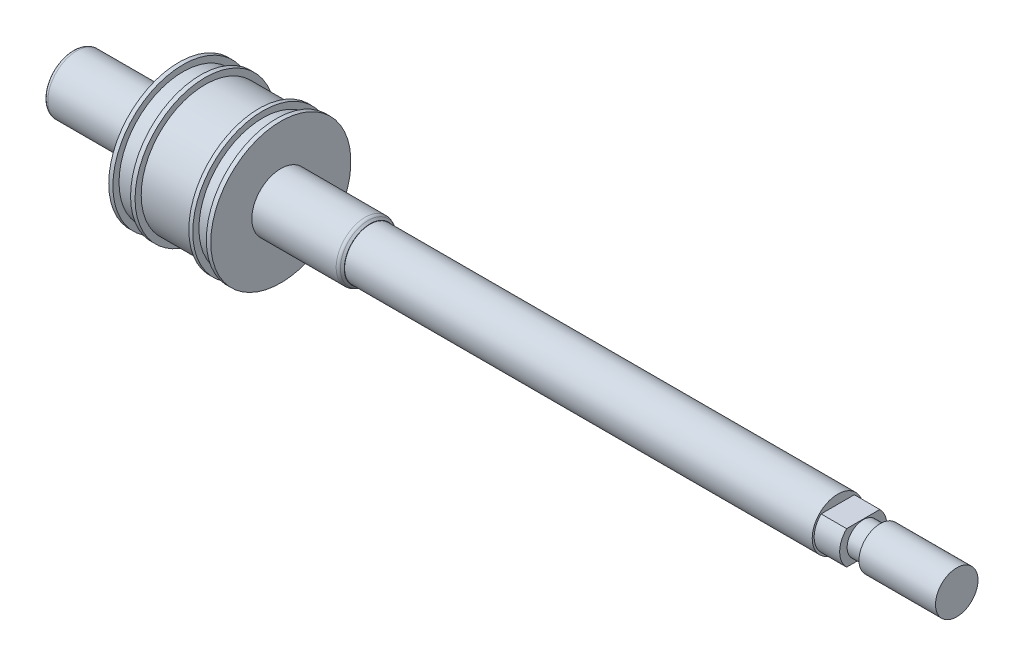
ISO-10303-21;
HEADER;
FILE_DESCRIPTION(('STEP AP214'),'2;1');
FILE_NAME('part.step','',(''),(''),'','','');
FILE_SCHEMA(('AUTOMOTIVE_DESIGN { 1 0 10303 214 1 1 1 1 }'));
ENDSEC;
DATA;
#1=APPLICATION_CONTEXT('core data for automotive mechanical design processes');
#2=APPLICATION_PROTOCOL_DEFINITION('international standard','automotive_design',2000,#1);
#3=PRODUCT_CONTEXT('',#1,'mechanical');
#4=PRODUCT('Part','Part','',(#3));
#5=PRODUCT_RELATED_PRODUCT_CATEGORY('part','',(#4));
#6=PRODUCT_DEFINITION_FORMATION('','',#4);
#7=PRODUCT_DEFINITION_CONTEXT('part definition',#1,'design');
#8=PRODUCT_DEFINITION('design','',#6,#7);
#9=PRODUCT_DEFINITION_SHAPE('','',#8);
#10=(LENGTH_UNIT() NAMED_UNIT(*) SI_UNIT(.MILLI.,.METRE.));
#11=(NAMED_UNIT(*) PLANE_ANGLE_UNIT() SI_UNIT($,.RADIAN.));
#12=(NAMED_UNIT(*) SI_UNIT($,.STERADIAN.) SOLID_ANGLE_UNIT());
#13=UNCERTAINTY_MEASURE_WITH_UNIT(LENGTH_MEASURE(1.E-05),#10,'distance_accuracy_value','');
#14=(GEOMETRIC_REPRESENTATION_CONTEXT(3) GLOBAL_UNCERTAINTY_ASSIGNED_CONTEXT((#13)) GLOBAL_UNIT_ASSIGNED_CONTEXT((#10,
#11,#12)) REPRESENTATION_CONTEXT('',''));
#15=CARTESIAN_POINT('',(0.,0.,0.));
#16=DIRECTION('',(0.,0.,1.));
#17=DIRECTION('',(1.,0.,0.));
#18=AXIS2_PLACEMENT_3D('',#15,#16,#17);
#19=CARTESIAN_POINT('',(49.,0.,0.));
#20=DIRECTION('',(-1.,0.,0.));
#21=DIRECTION('',(0.,0.,1.));
#22=AXIS2_PLACEMENT_3D('',#19,#20,#21);
#23=CYLINDRICAL_SURFACE('',#22,16.4793670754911);
#24=CARTESIAN_POINT('',(49.,0.,0.));
#25=DIRECTION('',(-1.,0.,0.));
#26=DIRECTION('',(0.,0.,1.));
#27=AXIS2_PLACEMENT_3D('',#24,#25,#26);
#28=CIRCLE('',#27,16.4793670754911);
#29=CARTESIAN_POINT('',(49.,0.,16.4793670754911));
#30=VERTEX_POINT('',#29);
#31=EDGE_CURVE('E139',#30,#30,#28,.T.);
#32=ORIENTED_EDGE('',*,*,#31,.T.);
#33=EDGE_LOOP('',(#32));
#34=FACE_BOUND('',#33,.T.);
#35=CARTESIAN_POINT('',(47.9508311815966,0.,0.));
#36=DIRECTION('',(-1.,0.,0.));
#37=DIRECTION('',(0.,0.,1.));
#38=AXIS2_PLACEMENT_3D('',#35,#36,#37);
#39=CIRCLE('',#38,16.4793670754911);
#40=CARTESIAN_POINT('',(47.9508311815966,0.,16.4793670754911));
#41=VERTEX_POINT('',#40);
#42=EDGE_CURVE('E155',#41,#41,#39,.F.);
#43=ORIENTED_EDGE('',*,*,#42,.T.);
#44=EDGE_LOOP('',(#43));
#45=FACE_BOUND('',#44,.T.);
#46=ADVANCED_FACE('F34',(#34,#45),#23,.T.);
#47=CARTESIAN_POINT('',(70.,0.,0.));
#48=DIRECTION('',(-1.,0.,0.));
#49=DIRECTION('',(0.,0.,1.));
#50=AXIS2_PLACEMENT_3D('',#47,#48,#49);
#51=CYLINDRICAL_SURFACE('',#50,6.82545551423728);
#52=CARTESIAN_POINT('',(68.835786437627,0.,0.));
#53=DIRECTION('',(1.,0.,0.));
#54=DIRECTION('',(0.,0.,-1.));
#55=AXIS2_PLACEMENT_3D('',#52,#53,#54);
#56=CIRCLE('',#55,6.82545551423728);
#57=CARTESIAN_POINT('',(68.835786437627,0.,-6.82545551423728));
#58=VERTEX_POINT('',#57);
#59=EDGE_CURVE('E124',#58,#58,#56,.F.);
#60=ORIENTED_EDGE('',*,*,#59,.T.);
#61=EDGE_LOOP('',(#60));
#62=FACE_BOUND('',#61,.T.);
#63=CARTESIAN_POINT('',(49.,0.,0.));
#64=DIRECTION('',(-1.,0.,0.));
#65=DIRECTION('',(0.,0.,1.));
#66=AXIS2_PLACEMENT_3D('',#63,#64,#65);
#67=CIRCLE('',#66,6.82545551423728);
#68=CARTESIAN_POINT('',(49.,0.,6.82545551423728));
#69=VERTEX_POINT('',#68);
#70=EDGE_CURVE('E135',#69,#69,#67,.F.);
#71=ORIENTED_EDGE('',*,*,#70,.T.);
#72=EDGE_LOOP('',(#71));
#73=FACE_BOUND('',#72,.T.);
#74=ADVANCED_FACE('F205',(#62,#73),#51,.T.);
#75=CARTESIAN_POINT('',(180.,0.,0.));
#76=DIRECTION('',(-1.,0.,0.));
#77=DIRECTION('',(0.,0.,1.));
#78=AXIS2_PLACEMENT_3D('',#75,#76,#77);
#79=CYLINDRICAL_SURFACE('',#78,6.);
#80=CARTESIAN_POINT('',(180.,0.,0.));
#81=DIRECTION('',(1.,0.,0.));
#82=DIRECTION('',(0.,0.,-1.));
#83=AXIS2_PLACEMENT_3D('',#80,#81,#82);
#84=CIRCLE('',#83,6.);
#85=CARTESIAN_POINT('',(180.,0.,6.));
#86=VERTEX_POINT('',#85);
#87=EDGE_CURVE('E115',#86,#86,#84,.T.);
#88=CARTESIAN_POINT('',(70.,0.,0.));
#89=DIRECTION('',(-1.,0.,0.));
#90=DIRECTION('',(0.,0.,1.));
#91=AXIS2_PLACEMENT_3D('',#88,#89,#90);
#92=CIRCLE('',#91,6.);
#93=CARTESIAN_POINT('',(70.,0.,6.));
#94=VERTEX_POINT('',#93);
#95=EDGE_CURVE('E118',#94,#94,#92,.T.);
#96=CARTESIAN_POINT('',(180.,0.,6.));
#97=CARTESIAN_POINT('',(178.854166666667,0.,6.));
#98=CARTESIAN_POINT('',(177.708333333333,0.,6.));
#99=CARTESIAN_POINT('',(175.416666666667,0.,6.));
#100=CARTESIAN_POINT('',(174.270833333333,0.,6.));
#101=CARTESIAN_POINT('',(171.979166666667,0.,6.));
#102=CARTESIAN_POINT('',(170.833333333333,0.,6.));
#103=CARTESIAN_POINT('',(168.541666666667,0.,6.));
#104=CARTESIAN_POINT('',(167.395833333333,0.,6.));
#105=CARTESIAN_POINT('',(165.104166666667,0.,6.));
#106=CARTESIAN_POINT('',(163.958333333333,0.,6.));
#107=CARTESIAN_POINT('',(161.666666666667,0.,6.));
#108=CARTESIAN_POINT('',(160.520833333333,0.,6.));
#109=CARTESIAN_POINT('',(158.229166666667,0.,6.));
#110=CARTESIAN_POINT('',(157.083333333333,0.,6.));
#111=CARTESIAN_POINT('',(154.791666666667,0.,6.));
#112=CARTESIAN_POINT('',(153.645833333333,0.,6.));
#113=CARTESIAN_POINT('',(151.354166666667,0.,6.));
#114=CARTESIAN_POINT('',(150.208333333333,0.,6.));
#115=CARTESIAN_POINT('',(147.916666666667,0.,6.));
#116=CARTESIAN_POINT('',(146.770833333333,0.,6.));
#117=CARTESIAN_POINT('',(144.479166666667,0.,6.));
#118=CARTESIAN_POINT('',(143.333333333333,0.,6.));
#119=CARTESIAN_POINT('',(141.041666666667,0.,6.));
#120=CARTESIAN_POINT('',(139.895833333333,0.,6.));
#121=CARTESIAN_POINT('',(137.604166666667,0.,6.));
#122=CARTESIAN_POINT('',(136.458333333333,0.,6.));
#123=CARTESIAN_POINT('',(134.166666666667,0.,6.));
#124=CARTESIAN_POINT('',(133.020833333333,0.,6.));
#125=CARTESIAN_POINT('',(130.729166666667,0.,6.));
#126=CARTESIAN_POINT('',(129.583333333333,0.,6.));
#127=CARTESIAN_POINT('',(127.291666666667,0.,6.));
#128=CARTESIAN_POINT('',(126.145833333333,0.,6.));
#129=CARTESIAN_POINT('',(123.854166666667,0.,6.));
#130=CARTESIAN_POINT('',(122.708333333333,0.,6.));
#131=CARTESIAN_POINT('',(120.416666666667,0.,6.));
#132=CARTESIAN_POINT('',(119.270833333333,0.,6.));
#133=CARTESIAN_POINT('',(116.979166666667,0.,6.));
#134=CARTESIAN_POINT('',(115.833333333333,0.,6.));
#135=CARTESIAN_POINT('',(113.541666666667,0.,6.));
#136=CARTESIAN_POINT('',(112.395833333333,0.,6.));
#137=CARTESIAN_POINT('',(110.104166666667,0.,6.));
#138=CARTESIAN_POINT('',(108.958333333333,0.,6.));
#139=CARTESIAN_POINT('',(106.666666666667,0.,6.));
#140=CARTESIAN_POINT('',(105.520833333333,0.,6.));
#141=CARTESIAN_POINT('',(103.229166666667,0.,6.));
#142=CARTESIAN_POINT('',(102.083333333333,0.,6.));
#143=CARTESIAN_POINT('',(99.7916666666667,0.,6.));
#144=CARTESIAN_POINT('',(98.6458333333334,0.,6.));
#145=CARTESIAN_POINT('',(96.3541666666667,0.,6.));
#146=CARTESIAN_POINT('',(95.2083333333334,0.,6.));
#147=CARTESIAN_POINT('',(92.9166666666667,0.,6.));
#148=CARTESIAN_POINT('',(91.7708333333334,0.,6.));
#149=CARTESIAN_POINT('',(89.4791666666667,0.,6.));
#150=CARTESIAN_POINT('',(88.3333333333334,0.,6.));
#151=CARTESIAN_POINT('',(86.0416666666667,0.,6.));
#152=CARTESIAN_POINT('',(84.8958333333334,0.,6.));
#153=CARTESIAN_POINT('',(82.6041666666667,0.,6.));
#154=CARTESIAN_POINT('',(81.4583333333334,0.,6.));
#155=CARTESIAN_POINT('',(79.1666666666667,0.,6.));
#156=CARTESIAN_POINT('',(78.0208333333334,0.,6.));
#157=CARTESIAN_POINT('',(75.7291666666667,0.,6.));
#158=CARTESIAN_POINT('',(74.5833333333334,0.,6.));
#159=CARTESIAN_POINT('',(72.2916666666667,0.,6.));
#160=CARTESIAN_POINT('',(71.1458333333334,0.,6.));
#161=CARTESIAN_POINT('',(70.,0.,6.));
#162=B_SPLINE_CURVE_WITH_KNOTS('',3,(#96,#97,#98,#99,#100,#101,#102,#103,#104,#105,#106,#107,
#108,#109,#110,#111,#112,#113,#114,#115,#116,#117,#118,#119,#120,#121,#122,#123,#124,#125,#126,
#127,#128,#129,#130,#131,#132,#133,#134,#135,#136,#137,#138,#139,#140,#141,#142,#143,#144,#145,
#146,#147,#148,#149,#150,#151,#152,#153,#154,#155,#156,#157,#158,#159,#160,#161),.UNSPECIFIED.,
.F.,.F.,(4,2,2,2,2,2,2,2,2,2,2,2,2,2,2,2,2,2,2,2,2,2,2,2,2,2,2,2,2,2,2,2,4),(0.,
3.43749999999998,6.87499999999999,10.3125,13.75,17.1875,20.625,24.0625,27.5,30.9375,34.375,
37.8124999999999,41.25,44.6875,48.1249999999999,51.5625,55.,58.4375,61.875,65.3124999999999,
68.7499999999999,72.1874999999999,75.6249999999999,79.0624999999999,82.4999999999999,
85.9374999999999,89.3749999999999,92.8124999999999,96.2499999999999,99.6874999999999,103.125,
106.5625,110.),.UNSPECIFIED.);
#163=EDGE_CURVE('BSEAM196',#86,#94,#162,.T.);
#164=ORIENTED_EDGE('',*,*,#87,.F.);
#165=ORIENTED_EDGE('',*,*,#95,.F.);
#166=ORIENTED_EDGE('',*,*,#163,.T.);
#167=ORIENTED_EDGE('',*,*,#163,.F.);
#168=EDGE_LOOP('',(#164,#166,#165,#167));
#169=FACE_BOUND('',#168,.T.);
#170=ADVANCED_FACE('F196',(#169),#79,.T.);
#171=CARTESIAN_POINT('',(186.,0.,0.));
#172=DIRECTION('',(1.,0.,0.));
#173=DIRECTION('',(0.,0.,-1.));
#174=AXIS2_PLACEMENT_3D('',#171,#172,#173);
#175=PLANE('',#174);
#176=CARTESIAN_POINT('',(186.,0.,0.));
#177=DIRECTION('',(1.,0.,0.));
#178=DIRECTION('',(0.,0.,-1.));
#179=AXIS2_PLACEMENT_3D('',#176,#177,#178);
#180=CIRCLE('',#179,5.53675717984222);
#181=CARTESIAN_POINT('',(186.,3.92396631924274,3.90617055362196));
#182=VERTEX_POINT('',#181);
#183=CARTESIAN_POINT('',(186.,-3.92396631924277,3.90617055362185));
#184=VERTEX_POINT('',#183);
#185=EDGE_CURVE('E86',#182,#184,#180,.T.);
#186=ORIENTED_EDGE('',*,*,#185,.T.);
#187=DIRECTION('',(0.,0.,-1.));
#188=VECTOR('',#187,1.);
#189=CARTESIAN_POINT('',(186.,-3.92396631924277,-3.90617055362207));
#190=LINE('',#189,#188);
#191=CARTESIAN_POINT('',(186.,-3.92396631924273,-3.90617055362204));
#192=VERTEX_POINT('',#191);
#193=EDGE_CURVE('E80',#184,#192,#190,.T.);
#194=ORIENTED_EDGE('',*,*,#193,.T.);
#195=CARTESIAN_POINT('',(186.,0.,0.));
#196=DIRECTION('',(1.,0.,0.));
#197=DIRECTION('',(0.,0.,-1.));
#198=AXIS2_PLACEMENT_3D('',#195,#196,#197);
#199=CIRCLE('',#198,5.5367571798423);
#200=CARTESIAN_POINT('',(186.,3.92396631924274,-3.90617055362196));
#201=VERTEX_POINT('',#200);
#202=EDGE_CURVE('E84',#192,#201,#199,.T.);
#203=ORIENTED_EDGE('',*,*,#202,.T.);
#204=DIRECTION('',(0.,0.,1.));
#205=VECTOR('',#204,1.);
#206=CARTESIAN_POINT('',(186.,3.92396631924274,3.90617055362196));
#207=LINE('',#206,#205);
#208=EDGE_CURVE('E59',#201,#182,#207,.T.);
#209=ORIENTED_EDGE('',*,*,#208,.T.);
#210=EDGE_LOOP('',(#186,#194,#203,#209));
#211=FACE_BOUND('',#210,.T.);
#212=CARTESIAN_POINT('',(186.,0.,0.));
#213=DIRECTION('',(1.,0.,0.));
#214=DIRECTION('',(0.,0.,-1.));
#215=AXIS2_PLACEMENT_3D('',#212,#213,#214);
#216=CIRCLE('',#215,3.78830754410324);
#217=CARTESIAN_POINT('',(186.,0.,-3.78830754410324));
#218=VERTEX_POINT('',#217);
#219=EDGE_CURVE('E185',#218,#218,#216,.T.);
#220=ORIENTED_EDGE('',*,*,#219,.F.);
#221=EDGE_LOOP('',(#220));
#222=FACE_BOUND('',#221,.T.);
#223=ADVANCED_FACE('F81',(#211,#222),#175,.T.);
#224=CARTESIAN_POINT('',(180.,0.,0.));
#225=DIRECTION('',(1.,0.,0.));
#226=DIRECTION('',(0.,0.,-1.));
#227=AXIS2_PLACEMENT_3D('',#224,#225,#226);
#228=PLANE('',#227);
#229=ORIENTED_EDGE('',*,*,#87,.T.);
#230=EDGE_LOOP('',(#229));
#231=FACE_BOUND('',#230,.T.);
#232=DIRECTION('',(0.,0.,-1.));
#233=VECTOR('',#232,1.);
#234=CARTESIAN_POINT('',(180.,-3.92396631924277,-3.90617055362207));
#235=LINE('',#234,#233);
#236=CARTESIAN_POINT('',(180.,-3.92396631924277,3.90617055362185));
#237=VERTEX_POINT('',#236);
#238=CARTESIAN_POINT('',(180.,-3.92396631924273,-3.90617055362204));
#239=VERTEX_POINT('',#238);
#240=EDGE_CURVE('E93',#237,#239,#235,.T.);
#241=ORIENTED_EDGE('',*,*,#240,.F.);
#242=CARTESIAN_POINT('',(180.,0.,0.));
#243=DIRECTION('',(1.,0.,0.));
#244=DIRECTION('',(0.,0.,-1.));
#245=AXIS2_PLACEMENT_3D('',#242,#243,#244);
#246=CIRCLE('',#245,5.53675717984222);
#247=CARTESIAN_POINT('',(180.,3.92396631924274,3.90617055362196));
#248=VERTEX_POINT('',#247);
#249=EDGE_CURVE('E104',#248,#237,#246,.T.);
#250=ORIENTED_EDGE('',*,*,#249,.F.);
#251=DIRECTION('',(0.,0.,1.));
#252=VECTOR('',#251,1.);
#253=CARTESIAN_POINT('',(180.,3.92396631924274,3.90617055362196));
#254=LINE('',#253,#252);
#255=CARTESIAN_POINT('',(180.,3.92396631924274,-3.90617055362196));
#256=VERTEX_POINT('',#255);
#257=EDGE_CURVE('E73',#256,#248,#254,.T.);
#258=ORIENTED_EDGE('',*,*,#257,.F.);
#259=CARTESIAN_POINT('',(180.,0.,0.));
#260=DIRECTION('',(1.,0.,0.));
#261=DIRECTION('',(0.,0.,-1.));
#262=AXIS2_PLACEMENT_3D('',#259,#260,#261);
#263=CIRCLE('',#262,5.5367571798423);
#264=EDGE_CURVE('E109',#239,#256,#263,.T.);
#265=ORIENTED_EDGE('',*,*,#264,.F.);
#266=EDGE_LOOP('',(#241,#250,#258,#265));
#267=FACE_BOUND('',#266,.T.);
#268=ADVANCED_FACE('F195',(#231,#267),#228,.T.);
#269=CARTESIAN_POINT('',(186.,0.,0.));
#270=DIRECTION('',(-1.,0.,0.));
#271=DIRECTION('',(0.,0.,1.));
#272=AXIS2_PLACEMENT_3D('',#269,#270,#271);
#273=CYLINDRICAL_SURFACE('',#272,5.53675717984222);
#274=ORIENTED_EDGE('',*,*,#249,.T.);
#275=DIRECTION('',(-1.,0.,0.));
#276=VECTOR('',#275,1.);
#277=CARTESIAN_POINT('',(186.,-3.92396631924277,3.90617055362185));
#278=LINE('',#277,#276);
#279=EDGE_CURVE('E96',#184,#237,#278,.T.);
#280=ORIENTED_EDGE('',*,*,#279,.F.);
#281=ORIENTED_EDGE('',*,*,#185,.F.);
#282=DIRECTION('',(-1.,0.,0.));
#283=VECTOR('',#282,1.);
#284=CARTESIAN_POINT('',(186.,3.92396631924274,3.90617055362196));
#285=LINE('',#284,#283);
#286=EDGE_CURVE('E100',#182,#248,#285,.T.);
#287=ORIENTED_EDGE('',*,*,#286,.T.);
#288=EDGE_LOOP('',(#274,#280,#281,#287));
#289=FACE_BOUND('',#288,.T.);
#290=ADVANCED_FACE('F202',(#289),#273,.T.);
#291=CARTESIAN_POINT('',(186.,-3.92396631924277,-3.90617055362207));
#292=DIRECTION('',(0.,1.,0.));
#293=DIRECTION('',(0.,0.,1.));
#294=AXIS2_PLACEMENT_3D('',#291,#292,#293);
#295=PLANE('',#294);
#296=ORIENTED_EDGE('',*,*,#240,.T.);
#297=DIRECTION('',(-1.,0.,0.));
#298=VECTOR('',#297,1.);
#299=CARTESIAN_POINT('',(186.,-3.92396631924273,-3.90617055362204));
#300=LINE('',#299,#298);
#301=EDGE_CURVE('E90',#192,#239,#300,.T.);
#302=ORIENTED_EDGE('',*,*,#301,.F.);
#303=ORIENTED_EDGE('',*,*,#193,.F.);
#304=ORIENTED_EDGE('',*,*,#279,.T.);
#305=EDGE_LOOP('',(#296,#302,#303,#304));
#306=FACE_BOUND('',#305,.T.);
#307=ADVANCED_FACE('F91',(#306),#295,.F.);
#308=CARTESIAN_POINT('',(186.,0.,0.));
#309=DIRECTION('',(-1.,0.,0.));
#310=DIRECTION('',(0.,0.,1.));
#311=AXIS2_PLACEMENT_3D('',#308,#309,#310);
#312=CYLINDRICAL_SURFACE('',#311,5.5367571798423);
#313=ORIENTED_EDGE('',*,*,#264,.T.);
#314=DIRECTION('',(-1.,0.,0.));
#315=VECTOR('',#314,1.);
#316=CARTESIAN_POINT('',(186.,3.92396631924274,-3.90617055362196));
#317=LINE('',#316,#315);
#318=EDGE_CURVE('E51',#201,#256,#317,.T.);
#319=ORIENTED_EDGE('',*,*,#318,.F.);
#320=ORIENTED_EDGE('',*,*,#202,.F.);
#321=ORIENTED_EDGE('',*,*,#301,.T.);
#322=EDGE_LOOP('',(#313,#319,#320,#321));
#323=FACE_BOUND('',#322,.T.);
#324=ADVANCED_FACE('F98',(#323),#312,.T.);
#325=CARTESIAN_POINT('',(186.,3.92396631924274,3.90617055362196));
#326=DIRECTION('',(0.,-1.,0.));
#327=DIRECTION('',(0.,0.,-1.));
#328=AXIS2_PLACEMENT_3D('',#325,#326,#327);
#329=PLANE('',#328);
#330=ORIENTED_EDGE('',*,*,#257,.T.);
#331=ORIENTED_EDGE('',*,*,#286,.F.);
#332=ORIENTED_EDGE('',*,*,#208,.F.);
#333=ORIENTED_EDGE('',*,*,#318,.T.);
#334=EDGE_LOOP('',(#330,#331,#332,#333));
#335=FACE_BOUND('',#334,.T.);
#336=ADVANCED_FACE('F304',(#335),#329,.F.);
#337=CARTESIAN_POINT('',(190.,0.,0.));
#338=DIRECTION('',(-1.,0.,0.));
#339=DIRECTION('',(0.,0.,1.));
#340=AXIS2_PLACEMENT_3D('',#337,#338,#339);
#341=CYLINDRICAL_SURFACE('',#340,3.78830754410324);
#342=CARTESIAN_POINT('',(190.,0.,0.));
#343=DIRECTION('',(1.,0.,0.));
#344=DIRECTION('',(0.,0.,-1.));
#345=AXIS2_PLACEMENT_3D('',#342,#343,#344);
#346=CIRCLE('',#345,3.78830754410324);
#347=CARTESIAN_POINT('',(190.,0.,-3.78830754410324));
#348=VERTEX_POINT('',#347);
#349=EDGE_CURVE('E107',#348,#348,#346,.T.);
#350=ORIENTED_EDGE('',*,*,#349,.F.);
#351=EDGE_LOOP('',(#350));
#352=FACE_BOUND('',#351,.T.);
#353=ORIENTED_EDGE('',*,*,#219,.T.);
#354=EDGE_LOOP('',(#353));
#355=FACE_BOUND('',#354,.T.);
#356=ADVANCED_FACE('F193',(#352,#355),#341,.T.);
#357=CARTESIAN_POINT('',(190.,0.,0.));
#358=DIRECTION('',(1.,0.,0.));
#359=DIRECTION('',(0.,0.,-1.));
#360=AXIS2_PLACEMENT_3D('',#357,#358,#359);
#361=PLANE('',#360);
#362=CARTESIAN_POINT('',(190.,0.,0.));
#363=DIRECTION('',(1.,0.,0.));
#364=DIRECTION('',(0.,0.,-1.));
#365=AXIS2_PLACEMENT_3D('',#362,#363,#364);
#366=CIRCLE('',#365,5.);
#367=CARTESIAN_POINT('',(190.,0.,-5.));
#368=VERTEX_POINT('',#367);
#369=EDGE_CURVE('E138',#368,#368,#366,.T.);
#370=ORIENTED_EDGE('',*,*,#369,.F.);
#371=EDGE_LOOP('',(#370));
#372=FACE_BOUND('',#371,.T.);
#373=ORIENTED_EDGE('',*,*,#349,.T.);
#374=EDGE_LOOP('',(#373));
#375=FACE_BOUND('',#374,.T.);
#376=ADVANCED_FACE('F309',(#372,#375),#361,.F.);
#377=CARTESIAN_POINT('',(208.,0.,0.));
#378=DIRECTION('',(-1.,0.,0.));
#379=DIRECTION('',(0.,0.,1.));
#380=AXIS2_PLACEMENT_3D('',#377,#378,#379);
#381=CYLINDRICAL_SURFACE('',#380,5.);
#382=CARTESIAN_POINT('',(208.,0.,0.));
#383=DIRECTION('',(1.,0.,0.));
#384=DIRECTION('',(0.,0.,-1.));
#385=AXIS2_PLACEMENT_3D('',#382,#383,#384);
#386=CIRCLE('',#385,5.);
#387=CARTESIAN_POINT('',(208.,0.,-5.));
#388=VERTEX_POINT('',#387);
#389=EDGE_CURVE('E182',#388,#388,#386,.T.);
#390=ORIENTED_EDGE('',*,*,#389,.F.);
#391=EDGE_LOOP('',(#390));
#392=FACE_BOUND('',#391,.T.);
#393=ORIENTED_EDGE('',*,*,#369,.T.);
#394=EDGE_LOOP('',(#393));
#395=FACE_BOUND('',#394,.T.);
#396=ADVANCED_FACE('F314',(#392,#395),#381,.T.);
#397=CARTESIAN_POINT('',(208.,0.,0.));
#398=DIRECTION('',(1.,0.,0.));
#399=DIRECTION('',(0.,0.,-1.));
#400=AXIS2_PLACEMENT_3D('',#397,#398,#399);
#401=PLANE('',#400);
#402=ORIENTED_EDGE('',*,*,#389,.T.);
#403=EDGE_LOOP('',(#402));
#404=FACE_BOUND('',#403,.T.);
#405=ADVANCED_FACE('F320',(#404),#401,.T.);
#406=CARTESIAN_POINT('',(70.,0.,0.));
#407=DIRECTION('',(-1.,0.,0.));
#408=DIRECTION('',(0.,0.,1.));
#409=AXIS2_PLACEMENT_3D('',#406,#407,#408);
#410=PLANE('',#409);
#411=CARTESIAN_POINT('',(70.,0.,0.));
#412=DIRECTION('',(-1.,0.,0.));
#413=DIRECTION('',(0.,0.,1.));
#414=AXIS2_PLACEMENT_3D('',#411,#412,#413);
#415=CIRCLE('',#414,6.07545551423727);
#416=CARTESIAN_POINT('',(70.,0.,6.07545551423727));
#417=VERTEX_POINT('',#416);
#418=EDGE_CURVE('E121',#417,#417,#415,.F.);
#419=ORIENTED_EDGE('',*,*,#418,.T.);
#420=EDGE_LOOP('',(#419));
#421=FACE_BOUND('',#420,.T.);
#422=ORIENTED_EDGE('',*,*,#95,.T.);
#423=EDGE_LOOP('',(#422));
#424=FACE_BOUND('',#423,.T.);
#425=ADVANCED_FACE('F287',(#421,#424),#410,.F.);
#426=CARTESIAN_POINT('',(69.25,0.,0.));
#427=DIRECTION('',(-1.,0.,0.));
#428=DIRECTION('',(0.,0.,1.));
#429=AXIS2_PLACEMENT_3D('',#426,#427,#428);
#430=CONICAL_SURFACE('',#429,6.82545551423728,0.785398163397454);
#431=CARTESIAN_POINT('',(69.5428932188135,0.,0.));
#432=DIRECTION('',(1.,0.,0.));
#433=DIRECTION('',(0.,0.,-1.));
#434=AXIS2_PLACEMENT_3D('',#431,#432,#433);
#435=CIRCLE('',#434,6.53256229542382);
#436=CARTESIAN_POINT('',(69.5428932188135,0.,-6.53256229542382));
#437=VERTEX_POINT('',#436);
#438=EDGE_CURVE('E127',#437,#437,#435,.T.);
#439=ORIENTED_EDGE('',*,*,#438,.T.);
#440=EDGE_LOOP('',(#439));
#441=FACE_BOUND('',#440,.T.);
#442=ORIENTED_EDGE('',*,*,#418,.F.);
#443=EDGE_LOOP('',(#442));
#444=FACE_BOUND('',#443,.T.);
#445=ADVANCED_FACE('F278',(#441,#444),#430,.T.);
#446=CARTESIAN_POINT('',(68.835786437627,0.,0.));
#447=DIRECTION('',(1.,0.,0.));
#448=DIRECTION('',(0.,0.,-1.));
#449=AXIS2_PLACEMENT_3D('',#446,#447,#448);
#450=TOROIDAL_SURFACE('',#449,5.82545551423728,1.);
#451=ORIENTED_EDGE('',*,*,#438,.F.);
#452=EDGE_LOOP('',(#451));
#453=FACE_BOUND('',#452,.T.);
#454=ORIENTED_EDGE('',*,*,#59,.F.);
#455=EDGE_LOOP('',(#454));
#456=FACE_BOUND('',#455,.T.);
#457=ADVANCED_FACE('F269',(#453,#456),#450,.T.);
#458=CARTESIAN_POINT('',(49.,0.,0.));
#459=DIRECTION('',(-1.,0.,0.));
#460=DIRECTION('',(0.,0.,1.));
#461=AXIS2_PLACEMENT_3D('',#458,#459,#460);
#462=PLANE('',#461);
#463=ORIENTED_EDGE('',*,*,#70,.F.);
#464=EDGE_LOOP('',(#463));
#465=FACE_BOUND('',#464,.T.);
#466=ORIENTED_EDGE('',*,*,#31,.F.);
#467=EDGE_LOOP('',(#466));
#468=FACE_BOUND('',#467,.T.);
#469=ADVANCED_FACE('F266',(#465,#468),#462,.F.);
#470=CARTESIAN_POINT('',(44.7669152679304,0.,-16.8481295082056));
#471=DIRECTION('',(1.,0.,0.));
#472=DIRECTION('',(0.,0.,-1.));
#473=AXIS2_PLACEMENT_3D('',#470,#471,#472);
#474=PLANE('',#473);
#475=CARTESIAN_POINT('',(44.7669152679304,0.,0.));
#476=DIRECTION('',(1.,0.,0.));
#477=DIRECTION('',(0.,0.,-1.));
#478=AXIS2_PLACEMENT_3D('',#475,#476,#477);
#479=CIRCLE('',#478,16.4793670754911);
#480=CARTESIAN_POINT('',(44.7669152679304,0.,-16.4793670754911));
#481=VERTEX_POINT('',#480);
#482=EDGE_CURVE('E38',#481,#481,#479,.F.);
#483=ORIENTED_EDGE('',*,*,#482,.F.);
#484=EDGE_LOOP('',(#483));
#485=FACE_BOUND('',#484,.T.);
#486=CARTESIAN_POINT('',(44.7669152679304,0.,0.));
#487=DIRECTION('',(-1.,0.,0.));
#488=DIRECTION('',(0.,0.,1.));
#489=AXIS2_PLACEMENT_3D('',#486,#487,#488);
#490=CIRCLE('',#489,15.0350662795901);
#491=CARTESIAN_POINT('',(44.7669152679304,0.,15.0350662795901));
#492=VERTEX_POINT('',#491);
#493=EDGE_CURVE('E157',#492,#492,#490,.T.);
#494=ORIENTED_EDGE('',*,*,#493,.T.);
#495=EDGE_LOOP('',(#494));
#496=FACE_BOUND('',#495,.T.);
#497=ADVANCED_FACE('F268',(#485,#496),#474,.T.);
#498=CARTESIAN_POINT('',(0.,0.,0.));
#499=DIRECTION('',(-1.,0.,0.));
#500=DIRECTION('',(0.,0.,1.));
#501=AXIS2_PLACEMENT_3D('',#498,#499,#500);
#502=CYLINDRICAL_SURFACE('',#501,15.0350662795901);
#503=CARTESIAN_POINT('',(47.9508311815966,0.,0.));
#504=DIRECTION('',(-1.,0.,0.));
#505=DIRECTION('',(0.,0.,1.));
#506=AXIS2_PLACEMENT_3D('',#503,#504,#505);
#507=CIRCLE('',#506,15.0350662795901);
#508=CARTESIAN_POINT('',(47.9508311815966,0.,15.0350662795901));
#509=VERTEX_POINT('',#508);
#510=EDGE_CURVE('E163',#509,#509,#507,.T.);
#511=ORIENTED_EDGE('',*,*,#510,.T.);
#512=EDGE_LOOP('',(#511));
#513=FACE_BOUND('',#512,.T.);
#514=ORIENTED_EDGE('',*,*,#493,.F.);
#515=EDGE_LOOP('',(#514));
#516=FACE_BOUND('',#515,.T.);
#517=ADVANCED_FACE('F275',(#513,#516),#502,.T.);
#518=CARTESIAN_POINT('',(47.9508311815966,0.,-16.8481295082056));
#519=DIRECTION('',(-1.,0.,0.));
#520=DIRECTION('',(0.,0.,1.));
#521=AXIS2_PLACEMENT_3D('',#518,#519,#520);
#522=PLANE('',#521);
#523=ORIENTED_EDGE('',*,*,#42,.F.);
#524=EDGE_LOOP('',(#523));
#525=FACE_BOUND('',#524,.T.);
#526=ORIENTED_EDGE('',*,*,#510,.F.);
#527=EDGE_LOOP('',(#526));
#528=FACE_BOUND('',#527,.T.);
#529=ADVANCED_FACE('F295',(#525,#528),#522,.T.);
#530=CARTESIAN_POINT('',(0.,0.,0.));
#531=DIRECTION('',(1.,0.,0.));
#532=DIRECTION('',(0.,0.,-1.));
#533=AXIS2_PLACEMENT_3D('',#530,#531,#532);
#534=PLANE('',#533);
#535=CARTESIAN_POINT('',(0.,0.,0.));
#536=DIRECTION('',(1.,0.,0.));
#537=DIRECTION('',(0.,0.,-1.));
#538=AXIS2_PLACEMENT_3D('',#535,#536,#537);
#539=CIRCLE('',#538,5.82545551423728);
#540=CARTESIAN_POINT('',(0.,0.,-5.82545551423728));
#541=VERTEX_POINT('',#540);
#542=EDGE_CURVE('E130',#541,#541,#539,.F.);
#543=ORIENTED_EDGE('',*,*,#542,.T.);
#544=EDGE_LOOP('',(#543));
#545=FACE_BOUND('',#544,.T.);
#546=ADVANCED_FACE('F293',(#545),#534,.F.);
#547=CARTESIAN_POINT('',(1.,0.,0.));
#548=DIRECTION('',(1.,0.,0.));
#549=DIRECTION('',(0.,0.,-1.));
#550=AXIS2_PLACEMENT_3D('',#547,#548,#549);
#551=TOROIDAL_SURFACE('',#550,5.82545551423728,1.);
#552=CARTESIAN_POINT('',(1.,0.,0.));
#553=DIRECTION('',(1.,0.,0.));
#554=DIRECTION('',(0.,0.,-1.));
#555=AXIS2_PLACEMENT_3D('',#552,#553,#554);
#556=CIRCLE('',#555,6.82545551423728);
#557=CARTESIAN_POINT('',(1.,0.,-6.82545551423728));
#558=VERTEX_POINT('',#557);
#559=EDGE_CURVE('E43',#558,#558,#556,.T.);
#560=ORIENTED_EDGE('',*,*,#559,.F.);
#561=EDGE_LOOP('',(#560));
#562=FACE_BOUND('',#561,.T.);
#563=ORIENTED_EDGE('',*,*,#542,.F.);
#564=EDGE_LOOP('',(#563));
#565=FACE_BOUND('',#564,.T.);
#566=ADVANCED_FACE('F36',(#562,#565),#551,.T.);
#567=CARTESIAN_POINT('',(25.,0.,0.));
#568=DIRECTION('',(-1.,0.,0.));
#569=DIRECTION('',(0.,0.,1.));
#570=AXIS2_PLACEMENT_3D('',#567,#568,#569);
#571=CIRCLE('',#570,6.82545551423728);
#572=CARTESIAN_POINT('',(25.,0.,6.82545551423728));
#573=VERTEX_POINT('',#572);
#574=EDGE_CURVE('E11',#573,#573,#571,.F.);
#575=ORIENTED_EDGE('',*,*,#574,.F.);
#576=EDGE_LOOP('',(#575));
#577=FACE_BOUND('',#576,.T.);
#578=ORIENTED_EDGE('',*,*,#559,.T.);
#579=EDGE_LOOP('',(#578));
#580=FACE_BOUND('',#579,.T.);
#581=ADVANCED_FACE('F220',(#577,#580),#51,.T.);
#582=CARTESIAN_POINT('',(25.,0.,0.));
#583=DIRECTION('',(-1.,0.,0.));
#584=DIRECTION('',(0.,0.,1.));
#585=AXIS2_PLACEMENT_3D('',#582,#583,#584);
#586=PLANE('',#585);
#587=ORIENTED_EDGE('',*,*,#574,.T.);
#588=EDGE_LOOP('',(#587));
#589=FACE_BOUND('',#588,.T.);
#590=CARTESIAN_POINT('',(25.,0.,0.));
#591=DIRECTION('',(-1.,0.,0.));
#592=DIRECTION('',(0.,0.,1.));
#593=AXIS2_PLACEMENT_3D('',#590,#591,#592);
#594=CIRCLE('',#593,16.4793670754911);
#595=CARTESIAN_POINT('',(25.,0.,16.4793670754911));
#596=VERTEX_POINT('',#595);
#597=EDGE_CURVE('E147',#596,#596,#594,.T.);
#598=ORIENTED_EDGE('',*,*,#597,.T.);
#599=EDGE_LOOP('',(#598));
#600=FACE_BOUND('',#599,.T.);
#601=ADVANCED_FACE('F240',(#589,#600),#586,.T.);
#602=ORIENTED_EDGE('',*,*,#597,.F.);
#603=EDGE_LOOP('',(#602));
#604=FACE_BOUND('',#603,.T.);
#605=CARTESIAN_POINT('',(25.9729671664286,0.,0.));
#606=DIRECTION('',(1.,0.,0.));
#607=DIRECTION('',(0.,0.,-1.));
#608=AXIS2_PLACEMENT_3D('',#605,#606,#607);
#609=CIRCLE('',#608,16.4793670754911);
#610=CARTESIAN_POINT('',(25.9729671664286,0.,-16.4793670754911));
#611=VERTEX_POINT('',#610);
#612=EDGE_CURVE('E143',#611,#611,#609,.F.);
#613=ORIENTED_EDGE('',*,*,#612,.T.);
#614=EDGE_LOOP('',(#613));
#615=FACE_BOUND('',#614,.T.);
#616=ADVANCED_FACE('F221',(#604,#615),#23,.T.);
#617=CARTESIAN_POINT('',(25.9729671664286,0.,-16.8481295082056));
#618=DIRECTION('',(1.,0.,0.));
#619=DIRECTION('',(0.,0.,-1.));
#620=AXIS2_PLACEMENT_3D('',#617,#618,#619);
#621=PLANE('',#620);
#622=ORIENTED_EDGE('',*,*,#612,.F.);
#623=EDGE_LOOP('',(#622));
#624=FACE_BOUND('',#623,.T.);
#625=CARTESIAN_POINT('',(25.9729671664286,0.,0.));
#626=DIRECTION('',(-1.,0.,0.));
#627=DIRECTION('',(0.,0.,1.));
#628=AXIS2_PLACEMENT_3D('',#625,#626,#627);
#629=CIRCLE('',#628,15.0350662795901);
#630=CARTESIAN_POINT('',(25.9729671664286,0.,15.0350662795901));
#631=VERTEX_POINT('',#630);
#632=EDGE_CURVE('E144',#631,#631,#629,.T.);
#633=ORIENTED_EDGE('',*,*,#632,.T.);
#634=EDGE_LOOP('',(#633));
#635=FACE_BOUND('',#634,.T.);
#636=ADVANCED_FACE('F239',(#624,#635),#621,.T.);
#637=CARTESIAN_POINT('',(0.,0.,0.));
#638=DIRECTION('',(-1.,0.,0.));
#639=DIRECTION('',(0.,0.,1.));
#640=AXIS2_PLACEMENT_3D('',#637,#638,#639);
#641=CYLINDRICAL_SURFACE('',#640,15.0350662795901);
#642=CARTESIAN_POINT('',(30.1297462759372,0.,0.));
#643=DIRECTION('',(-1.,0.,0.));
#644=DIRECTION('',(0.,0.,1.));
#645=AXIS2_PLACEMENT_3D('',#642,#643,#644);
#646=CIRCLE('',#645,15.0350662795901);
#647=CARTESIAN_POINT('',(30.1297462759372,0.,15.0350662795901));
#648=VERTEX_POINT('',#647);
#649=EDGE_CURVE('E154',#648,#648,#646,.T.);
#650=ORIENTED_EDGE('',*,*,#649,.T.);
#651=EDGE_LOOP('',(#650));
#652=FACE_BOUND('',#651,.T.);
#653=ORIENTED_EDGE('',*,*,#632,.F.);
#654=EDGE_LOOP('',(#653));
#655=FACE_BOUND('',#654,.T.);
#656=ADVANCED_FACE('F246',(#652,#655),#641,.T.);
#657=CARTESIAN_POINT('',(30.1297462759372,0.,-16.8481295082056));
#658=DIRECTION('',(-1.,0.,0.));
#659=DIRECTION('',(0.,0.,1.));
#660=AXIS2_PLACEMENT_3D('',#657,#658,#659);
#661=PLANE('',#660);
#662=CARTESIAN_POINT('',(30.1297462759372,0.,0.));
#663=DIRECTION('',(-1.,0.,0.));
#664=DIRECTION('',(0.,0.,1.));
#665=AXIS2_PLACEMENT_3D('',#662,#663,#664);
#666=CIRCLE('',#665,16.4793670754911);
#667=CARTESIAN_POINT('',(30.1297462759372,0.,16.4793670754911));
#668=VERTEX_POINT('',#667);
#669=EDGE_CURVE('E140',#668,#668,#666,.F.);
#670=ORIENTED_EDGE('',*,*,#669,.F.);
#671=EDGE_LOOP('',(#670));
#672=FACE_BOUND('',#671,.T.);
#673=ORIENTED_EDGE('',*,*,#649,.F.);
#674=EDGE_LOOP('',(#673));
#675=FACE_BOUND('',#674,.T.);
#676=ADVANCED_FACE('F226',(#672,#675),#661,.T.);
#677=ORIENTED_EDGE('',*,*,#669,.T.);
#678=EDGE_LOOP('',(#677));
#679=FACE_BOUND('',#678,.T.);
#680=CARTESIAN_POINT('',(31.1910515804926,0.,0.));
#681=DIRECTION('',(1.,0.,0.));
#682=DIRECTION('',(0.,0.,-1.));
#683=AXIS2_PLACEMENT_3D('',#680,#681,#682);
#684=CIRCLE('',#683,16.4793670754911);
#685=CARTESIAN_POINT('',(31.1910515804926,0.,-16.4793670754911));
#686=VERTEX_POINT('',#685);
#687=EDGE_CURVE('E151',#686,#686,#684,.F.);
#688=ORIENTED_EDGE('',*,*,#687,.T.);
#689=EDGE_LOOP('',(#688));
#690=FACE_BOUND('',#689,.T.);
#691=ADVANCED_FACE('F213',(#679,#690),#23,.T.);
#692=CARTESIAN_POINT('',(31.1910515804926,0.,-16.8481295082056));
#693=DIRECTION('',(1.,0.,0.));
#694=DIRECTION('',(0.,0.,-1.));
#695=AXIS2_PLACEMENT_3D('',#692,#693,#694);
#696=PLANE('',#695);
#697=ORIENTED_EDGE('',*,*,#687,.F.);
#698=EDGE_LOOP('',(#697));
#699=FACE_BOUND('',#698,.T.);
#700=CARTESIAN_POINT('',(31.1910515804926,0.,0.));
#701=DIRECTION('',(-1.,0.,0.));
#702=DIRECTION('',(0.,0.,1.));
#703=AXIS2_PLACEMENT_3D('',#700,#701,#702);
#704=CIRCLE('',#703,15.0350662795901);
#705=CARTESIAN_POINT('',(31.1910515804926,0.,15.0350662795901));
#706=VERTEX_POINT('',#705);
#707=EDGE_CURVE('E152',#706,#706,#704,.T.);
#708=ORIENTED_EDGE('',*,*,#707,.T.);
#709=EDGE_LOOP('',(#708));
#710=FACE_BOUND('',#709,.T.);
#711=ADVANCED_FACE('F225',(#699,#710),#696,.T.);
#712=CARTESIAN_POINT('',(0.,0.,0.));
#713=DIRECTION('',(-1.,0.,0.));
#714=DIRECTION('',(0.,0.,1.));
#715=AXIS2_PLACEMENT_3D('',#712,#713,#714);
#716=CYLINDRICAL_SURFACE('',#715,15.0350662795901);
#717=CARTESIAN_POINT('',(43.8382731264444,0.,0.));
#718=DIRECTION('',(-1.,0.,0.));
#719=DIRECTION('',(0.,0.,1.));
#720=AXIS2_PLACEMENT_3D('',#717,#718,#719);
#721=CIRCLE('',#720,15.0350662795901);
#722=CARTESIAN_POINT('',(43.8382731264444,0.,15.0350662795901));
#723=VERTEX_POINT('',#722);
#724=EDGE_CURVE('E161',#723,#723,#721,.T.);
#725=ORIENTED_EDGE('',*,*,#724,.T.);
#726=EDGE_LOOP('',(#725));
#727=FACE_BOUND('',#726,.T.);
#728=ORIENTED_EDGE('',*,*,#707,.F.);
#729=EDGE_LOOP('',(#728));
#730=FACE_BOUND('',#729,.T.);
#731=ADVANCED_FACE('F234',(#727,#730),#716,.T.);
#732=CARTESIAN_POINT('',(43.8382731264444,0.,-16.8481295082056));
#733=DIRECTION('',(-1.,0.,0.));
#734=DIRECTION('',(0.,0.,1.));
#735=AXIS2_PLACEMENT_3D('',#732,#733,#734);
#736=PLANE('',#735);
#737=CARTESIAN_POINT('',(43.8382731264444,0.,0.));
#738=DIRECTION('',(-1.,0.,0.));
#739=DIRECTION('',(0.,0.,1.));
#740=AXIS2_PLACEMENT_3D('',#737,#738,#739);
#741=CIRCLE('',#740,16.4793670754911);
#742=CARTESIAN_POINT('',(43.8382731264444,0.,16.4793670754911));
#743=VERTEX_POINT('',#742);
#744=EDGE_CURVE('E148',#743,#743,#741,.F.);
#745=ORIENTED_EDGE('',*,*,#744,.F.);
#746=EDGE_LOOP('',(#745));
#747=FACE_BOUND('',#746,.T.);
#748=ORIENTED_EDGE('',*,*,#724,.F.);
#749=EDGE_LOOP('',(#748));
#750=FACE_BOUND('',#749,.T.);
#751=ADVANCED_FACE('F229',(#747,#750),#736,.T.);
#752=ORIENTED_EDGE('',*,*,#744,.T.);
#753=EDGE_LOOP('',(#752));
#754=FACE_BOUND('',#753,.T.);
#755=ORIENTED_EDGE('',*,*,#482,.T.);
#756=EDGE_LOOP('',(#755));
#757=FACE_BOUND('',#756,.T.);
#758=ADVANCED_FACE('F214',(#754,#757),#23,.T.);
#759=CLOSED_SHELL('',(#46,#74,#170,#223,#268,#290,#307,#324,#336,#356,#376,#396,#405,#425,#445,
#457,#469,#497,#517,#529,#546,#566,#581,#601,#616,#636,#656,#676,#691,#711,#731,#751,#758));
#760=MANIFOLD_SOLID_BREP('B2',#759);
#761=ADVANCED_BREP_SHAPE_REPRESENTATION('',(#18,#760),#14);
#762=SHAPE_DEFINITION_REPRESENTATION(#9,#761);
ENDSEC;
END-ISO-10303-21;
